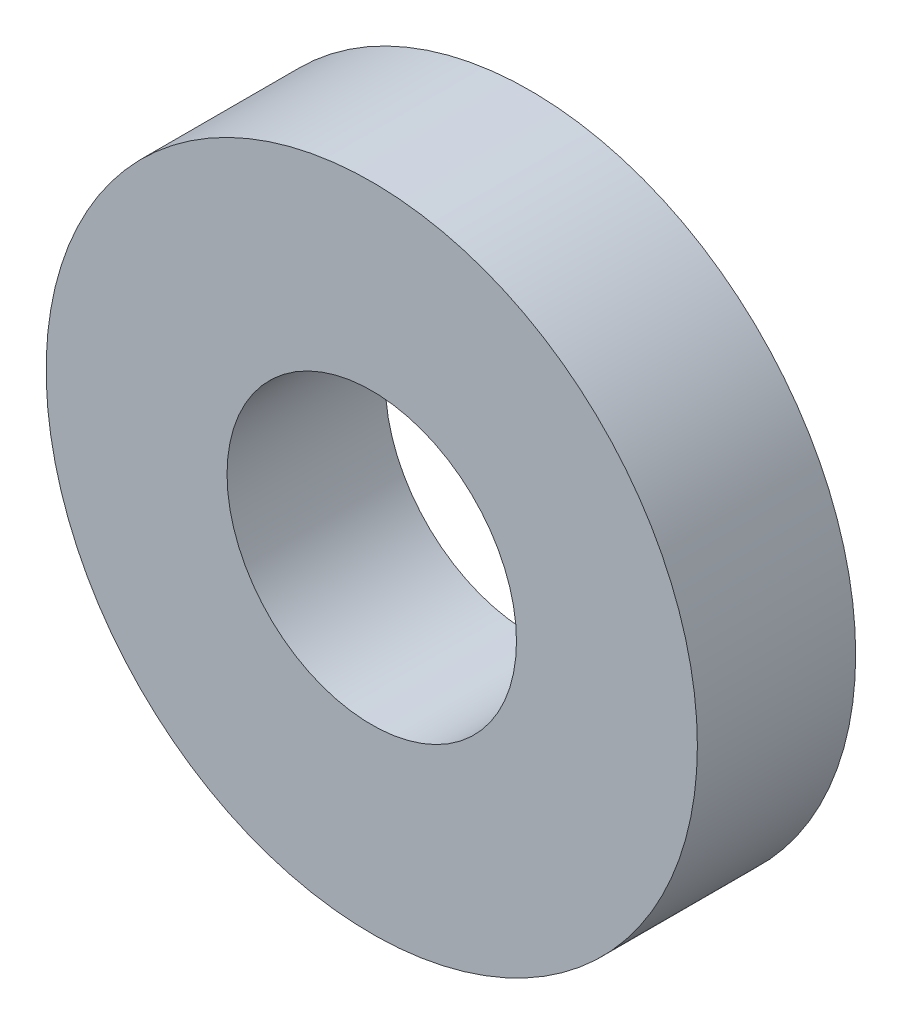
ISO-10303-21;
HEADER;
FILE_DESCRIPTION(('STEP AP214'),'2;1');
FILE_NAME('part.step','',(''),(''),'','','');
FILE_SCHEMA(('AUTOMOTIVE_DESIGN { 1 0 10303 214 1 1 1 1 }'));
ENDSEC;
DATA;
#1=APPLICATION_CONTEXT('core data for automotive mechanical design processes');
#2=APPLICATION_PROTOCOL_DEFINITION('international standard','automotive_design',2000,#1);
#3=PRODUCT_CONTEXT('',#1,'mechanical');
#4=PRODUCT('Part','Part','',(#3));
#5=PRODUCT_RELATED_PRODUCT_CATEGORY('part','',(#4));
#6=PRODUCT_DEFINITION_FORMATION('','',#4);
#7=PRODUCT_DEFINITION_CONTEXT('part definition',#1,'design');
#8=PRODUCT_DEFINITION('design','',#6,#7);
#9=PRODUCT_DEFINITION_SHAPE('','',#8);
#10=(LENGTH_UNIT() NAMED_UNIT(*) SI_UNIT(.MILLI.,.METRE.));
#11=(NAMED_UNIT(*) PLANE_ANGLE_UNIT() SI_UNIT($,.RADIAN.));
#12=(NAMED_UNIT(*) SI_UNIT($,.STERADIAN.) SOLID_ANGLE_UNIT());
#13=UNCERTAINTY_MEASURE_WITH_UNIT(LENGTH_MEASURE(1.E-05),#10,'distance_accuracy_value','');
#14=(GEOMETRIC_REPRESENTATION_CONTEXT(3) GLOBAL_UNCERTAINTY_ASSIGNED_CONTEXT((#13)) GLOBAL_UNIT_ASSIGNED_CONTEXT((#10,
#11,#12)) REPRESENTATION_CONTEXT('',''));
#15=CARTESIAN_POINT('',(0.,0.,0.));
#16=DIRECTION('',(0.,0.,1.));
#17=DIRECTION('',(1.,0.,0.));
#18=AXIS2_PLACEMENT_3D('',#15,#16,#17);
#19=CARTESIAN_POINT('',(0.,0.,3.5));
#20=DIRECTION('',(0.,0.,1.));
#21=DIRECTION('',(1.,0.,0.));
#22=AXIS2_PLACEMENT_3D('',#19,#20,#21);
#23=PLANE('',#22);
#24=CARTESIAN_POINT('',(0.,0.,3.5));
#25=DIRECTION('',(0.,0.,1.));
#26=DIRECTION('',(1.,0.,0.));
#27=AXIS2_PLACEMENT_3D('',#24,#25,#26);
#28=CIRCLE('',#27,7.2);
#29=CARTESIAN_POINT('',(7.2,0.,3.5));
#30=VERTEX_POINT('',#29);
#31=EDGE_CURVE('E10',#30,#30,#28,.T.);
#32=ORIENTED_EDGE('',*,*,#31,.T.);
#33=EDGE_LOOP('',(#32));
#34=FACE_BOUND('',#33,.T.);
#35=CARTESIAN_POINT('',(0.,0.,3.5));
#36=DIRECTION('',(0.,0.,1.));
#37=DIRECTION('',(1.,0.,0.));
#38=AXIS2_PLACEMENT_3D('',#35,#36,#37);
#39=CIRCLE('',#38,3.2);
#40=CARTESIAN_POINT('',(3.2,0.,3.5));
#41=VERTEX_POINT('',#40);
#42=EDGE_CURVE('E42',#41,#41,#39,.T.);
#43=ORIENTED_EDGE('',*,*,#42,.F.);
#44=EDGE_LOOP('',(#43));
#45=FACE_BOUND('',#44,.T.);
#46=ADVANCED_FACE('F31',(#34,#45),#23,.T.);
#47=CARTESIAN_POINT('',(0.,0.,0.));
#48=DIRECTION('',(0.,0.,1.));
#49=DIRECTION('',(1.,0.,0.));
#50=AXIS2_PLACEMENT_3D('',#47,#48,#49);
#51=PLANE('',#50);
#52=CARTESIAN_POINT('',(0.,0.,0.));
#53=DIRECTION('',(0.,0.,1.));
#54=DIRECTION('',(1.,0.,0.));
#55=AXIS2_PLACEMENT_3D('',#52,#53,#54);
#56=CIRCLE('',#55,7.2);
#57=CARTESIAN_POINT('',(7.2,0.,0.));
#58=VERTEX_POINT('',#57);
#59=EDGE_CURVE('E35',#58,#58,#56,.T.);
#60=ORIENTED_EDGE('',*,*,#59,.F.);
#61=EDGE_LOOP('',(#60));
#62=FACE_BOUND('',#61,.T.);
#63=CARTESIAN_POINT('',(0.,0.,0.));
#64=DIRECTION('',(0.,0.,1.));
#65=DIRECTION('',(1.,0.,0.));
#66=AXIS2_PLACEMENT_3D('',#63,#64,#65);
#67=CIRCLE('',#66,3.2);
#68=CARTESIAN_POINT('',(3.2,0.,0.));
#69=VERTEX_POINT('',#68);
#70=EDGE_CURVE('E44',#69,#69,#67,.T.);
#71=ORIENTED_EDGE('',*,*,#70,.T.);
#72=EDGE_LOOP('',(#71));
#73=FACE_BOUND('',#72,.T.);
#74=ADVANCED_FACE('F54',(#62,#73),#51,.F.);
#75=CARTESIAN_POINT('',(0.,0.,3.5));
#76=DIRECTION('',(0.,0.,-1.));
#77=DIRECTION('',(-1.,0.,0.));
#78=AXIS2_PLACEMENT_3D('',#75,#76,#77);
#79=CYLINDRICAL_SURFACE('',#78,7.2);
#80=ORIENTED_EDGE('',*,*,#31,.F.);
#81=EDGE_LOOP('',(#80));
#82=FACE_BOUND('',#81,.T.);
#83=ORIENTED_EDGE('',*,*,#59,.T.);
#84=EDGE_LOOP('',(#83));
#85=FACE_BOUND('',#84,.T.);
#86=ADVANCED_FACE('F33',(#82,#85),#79,.T.);
#87=CARTESIAN_POINT('',(0.,0.,3.5));
#88=DIRECTION('',(0.,0.,-1.));
#89=DIRECTION('',(-1.,0.,0.));
#90=AXIS2_PLACEMENT_3D('',#87,#88,#89);
#91=CYLINDRICAL_SURFACE('',#90,3.2);
#92=ORIENTED_EDGE('',*,*,#42,.T.);
#93=EDGE_LOOP('',(#92));
#94=FACE_BOUND('',#93,.T.);
#95=ORIENTED_EDGE('',*,*,#70,.F.);
#96=EDGE_LOOP('',(#95));
#97=FACE_BOUND('',#96,.T.);
#98=ADVANCED_FACE('F50',(#94,#97),#91,.F.);
#99=CLOSED_SHELL('',(#46,#74,#86,#98));
#100=MANIFOLD_SOLID_BREP('B2',#99);
#101=ADVANCED_BREP_SHAPE_REPRESENTATION('',(#18,#100),#14);
#102=SHAPE_DEFINITION_REPRESENTATION(#9,#101);
ENDSEC;
END-ISO-10303-21;
